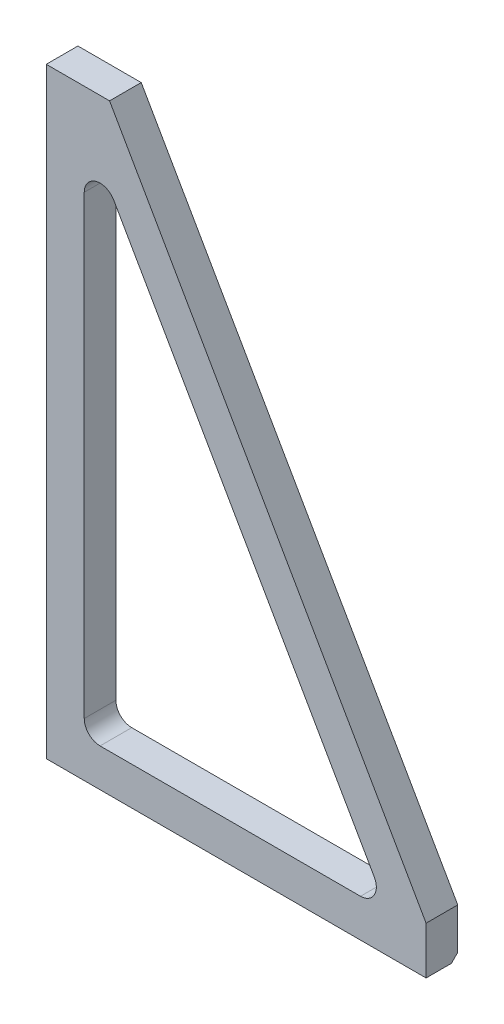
from build123d import *

# Parameters (mm, degrees)
BASE_EXTRUDE_DEPTH = 12.7
CHAMFER3_SIZE      = 2.54


with BuildPart() as part:
    # Sketch1 → Base-Extrude (new body)
    with BuildSketch(Plane.XY):
        Polygon((0, 0), (152.4, 0), (152.4, 19.05), (25.4, 241.3), (0, 241.3), align=None)
        with BuildLine():
            Line((15.24, 21.59), (15.24, 204.451463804))
            ThreePointArc((15.24, 204.451463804), (19.960158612, 210.588736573), (27.103343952, 207.601946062))
            Line((27.103343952, 207.601946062), (131.595608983, 24.740482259))
            ThreePointArc((131.595608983, 24.740482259), (131.574444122, 18.402764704), (126.082265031, 15.24))
            Line((126.082265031, 15.24), (21.59, 15.24))
            ThreePointArc((21.59, 15.24), (17.099871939, 17.099871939), (15.24, 21.59))
        make_face(mode=Mode.SUBTRACT)
    extrude(amount=BASE_EXTRUDE_DEPTH)

    # Chamfer3
    chamfer3_edges = [part.edges().sort_by_distance(p)[0] for p in [
        (76.2, 0, 0),
    ]]
    chamfer(chamfer3_edges, length=CHAMFER3_SIZE)


solid = part.part
